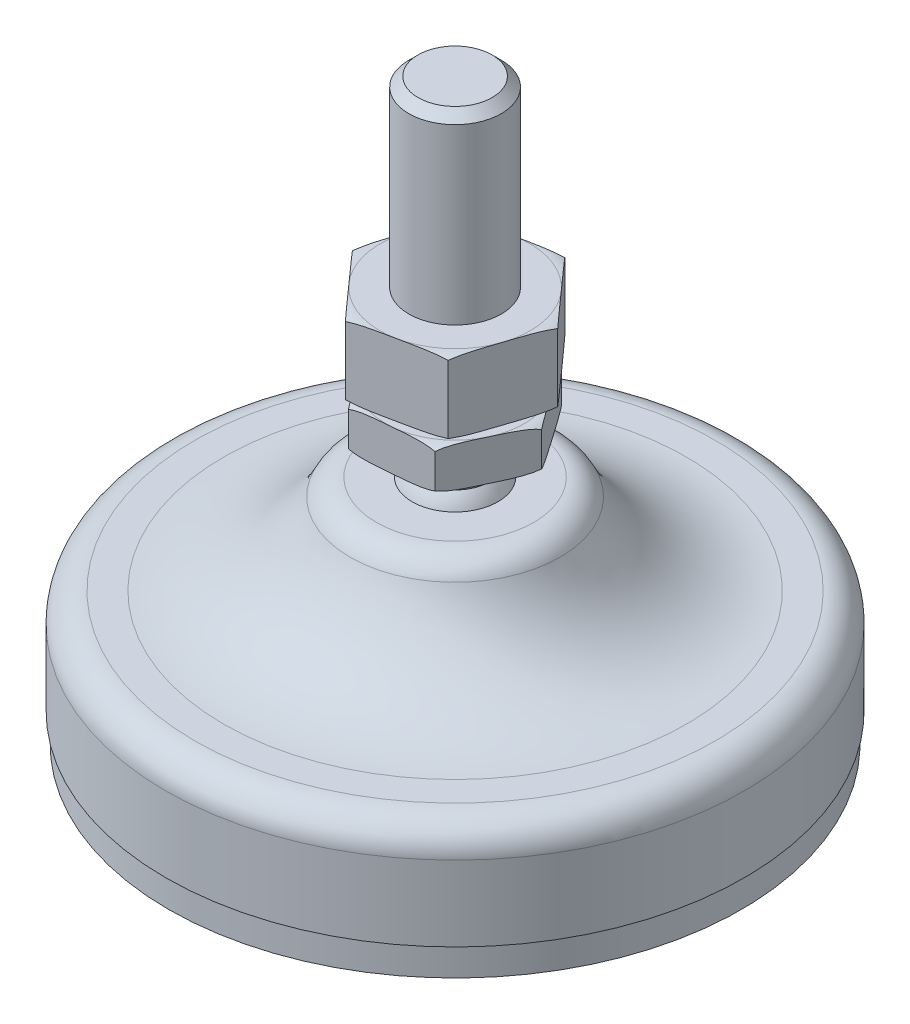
from build123d import *

# Parameters (mm, degrees)
ESQUISSE2_R             = 47.68207318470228
ENL_V_MAT_EXTRU_1_DEPTH = 8
ESQUISSE3_R             = 14.282697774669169
ENL_V_MAT_EXTRU_2_DEPTH = 4


with BuildPart() as part:
    # Esquisse1 → R_volution1 (revolve)
    with BuildSketch(Plane.XY, mode=Mode.PRIVATE) as r_volution1_sk:
        with BuildLine():
            Line((0, -34.51333348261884), (6.12e-15, -50))
            Line((6.12e-15, -50), (-24.749999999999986, -50))
            Line((-24.749999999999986, -50), (-24.749999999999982, -47.5))
            Line((-24.749999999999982, -47.5), (-24.999999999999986, -47.5))
            Line((-24.999999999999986, -47.5), (-24.999999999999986, -41.00000000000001))
            ThreePointArc((-24.999999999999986, -41.00000000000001), (-24.267766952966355, -39.23223304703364), (-22.49999999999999, -38.50000000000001))
            Line((-22.49999999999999, -38.50000000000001), (-19.999999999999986, -38.50000000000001))
            ThreePointArc((-19.999999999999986, -38.50000000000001), (-13.503316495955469, -36.58925683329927), (-9.075548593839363, -31.465517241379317))
            ThreePointArc((-9.075548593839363, -31.465517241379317), (-8.153096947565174, -30.39807149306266), (-6.799621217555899, -30.000000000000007))
            Line((-6.799621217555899, -30.000000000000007), (-3.7080992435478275, -30.000000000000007))
            ThreePointArc((-3.7080992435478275, -30.000000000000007), (-3.4026218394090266, -29.397105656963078), (-2.99999999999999, -28.854248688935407))
            Line((-2.99999999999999, -28.854248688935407), (-2.9999999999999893, -26.50000000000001))
            Line((-2.9999999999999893, -26.50000000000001), (-5.999999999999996, -26.50000000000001))
            ThreePointArc((-5.999999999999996, -26.50000000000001), (-7.749999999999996, -24.750000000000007), (-5.999999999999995, -23.000000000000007))
            Line((-5.999999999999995, -23.000000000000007), (-3.9999999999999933, -23.000000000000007))
            Line((-3.9999999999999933, -23.000000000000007), (-4, -22.000000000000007))
            Line((-4, -22.000000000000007), (-6.499999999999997, -22.000000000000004))
            ThreePointArc((-6.499999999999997, -22.000000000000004), (-9.599999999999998, -18.900000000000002), (-6.499999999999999, -15.8))
            Line((-6.499999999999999, -15.8), (-4.000000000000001, -15.8))
            Line((-4.000000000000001, -15.8), (-4, -0.7999999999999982))
            Line((-4, -0.7999999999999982), (-3.199999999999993, 0))
            Line((-3.199999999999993, 0), (0, 0))
            Line((0, 0), (0, -34.51333348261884))
        make_face()
    revolve(r_volution1_sk.sketch.rotate(Axis((0, 0, 0), (0, -1, 0)), 270), axis=Axis((0, 0, 0), (0, -1, 0)))

    # Esquisse2 → Enl_v. mat.-Extru.1 (cut)
    with BuildSketch(Plane(origin=(0, -15.8, 0), x_dir=(1, 0, 0), z_dir=(0, 1, 0))):
        Circle(ESQUISSE2_R)
        Polygon((-7.3495105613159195, -1.5225070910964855), (-2.356225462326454, -7.12611639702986), (4.993285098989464, -5.603609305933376), (7.349510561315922, 1.5225070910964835), (2.356225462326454, 7.126116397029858), (-4.99328509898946, 5.603609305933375), align=None, mode=Mode.SUBTRACT)
    extrude(amount=-ENL_V_MAT_EXTRU_1_DEPTH, mode=Mode.SUBTRACT)

    # Esquisse3 → Enl_v. mat.-Extru.2 (cut)
    with BuildSketch(Plane(origin=(0, -23.000000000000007, 0), x_dir=(1, 0, 0), z_dir=(0, 1, 0))):
        Circle(ESQUISSE3_R)
        Polygon((-3.95483326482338, 5.688522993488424), (-6.903822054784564, -0.5807245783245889), (-2.94898878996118, -6.269247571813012), (3.9548332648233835, -5.688522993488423), (6.903822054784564, 0.5807245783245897), (2.9489887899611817, 6.269247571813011), align=None, mode=Mode.SUBTRACT)
    extrude(amount=-ENL_V_MAT_EXTRU_2_DEPTH, mode=Mode.SUBTRACT)


solid = part.part
